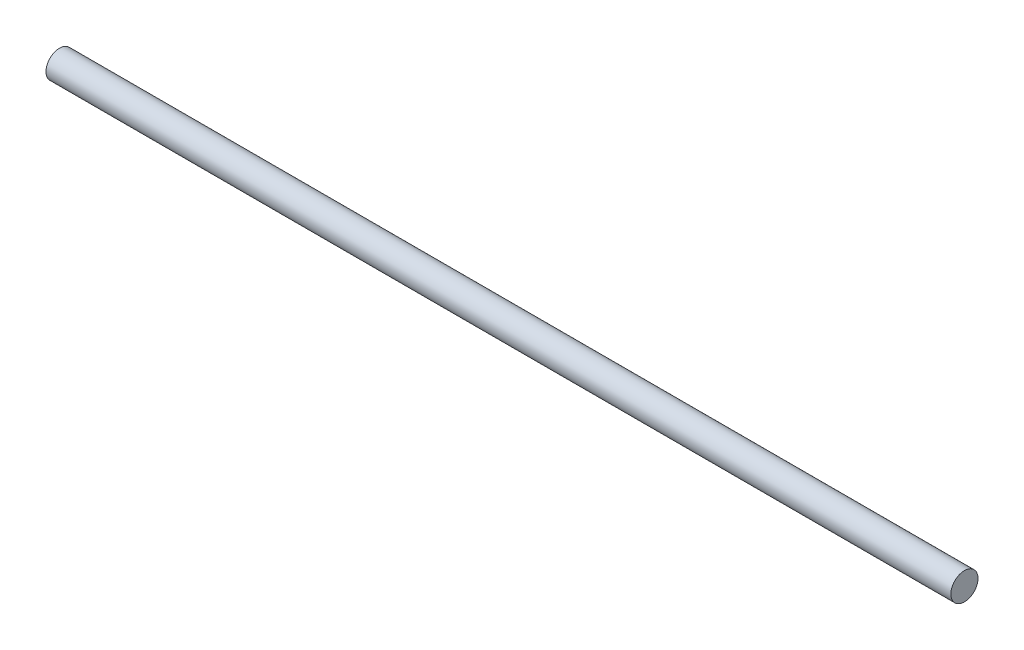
from build123d import *

# Parameters (mm, degrees)
BOSS_EXTRUDE1_DEPTH      = 25
BOSS_EXTRUDE1_DEPTH_BACK = 25
SKETCH1_R                = 0.75


with BuildPart() as part:
    # Sketch1 → Boss-Extrude1 (new, two sides: drawn at the far end of the back side and taken through both)
    with BuildSketch(Plane(origin=(0, 0, 0), x_dir=(0, 0, -1), z_dir=(1, 0, 0)).offset(-BOSS_EXTRUDE1_DEPTH_BACK)):
        Circle(SKETCH1_R)
    extrude(amount=BOSS_EXTRUDE1_DEPTH + BOSS_EXTRUDE1_DEPTH_BACK)


solid = part.part
